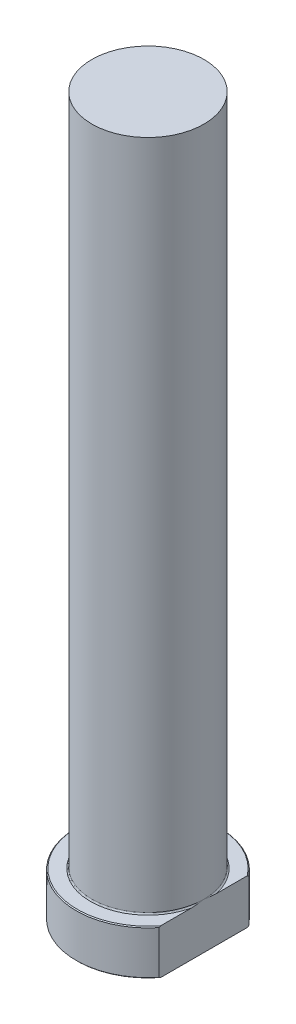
ISO-10303-21;
HEADER;
FILE_DESCRIPTION(('STEP AP214'),'2;1');
FILE_NAME('part.step','',(''),(''),'','','');
FILE_SCHEMA(('AUTOMOTIVE_DESIGN { 1 0 10303 214 1 1 1 1 }'));
ENDSEC;
DATA;
#1=APPLICATION_CONTEXT('core data for automotive mechanical design processes');
#2=APPLICATION_PROTOCOL_DEFINITION('international standard','automotive_design',2000,#1);
#3=PRODUCT_CONTEXT('',#1,'mechanical');
#4=PRODUCT('Part','Part','',(#3));
#5=PRODUCT_RELATED_PRODUCT_CATEGORY('part','',(#4));
#6=PRODUCT_DEFINITION_FORMATION('','',#4);
#7=PRODUCT_DEFINITION_CONTEXT('part definition',#1,'design');
#8=PRODUCT_DEFINITION('design','',#6,#7);
#9=PRODUCT_DEFINITION_SHAPE('','',#8);
#10=(LENGTH_UNIT() NAMED_UNIT(*) SI_UNIT(.MILLI.,.METRE.));
#11=(NAMED_UNIT(*) PLANE_ANGLE_UNIT() SI_UNIT($,.RADIAN.));
#12=(NAMED_UNIT(*) SI_UNIT($,.STERADIAN.) SOLID_ANGLE_UNIT());
#13=UNCERTAINTY_MEASURE_WITH_UNIT(LENGTH_MEASURE(1.E-05),#10,'distance_accuracy_value','');
#14=(GEOMETRIC_REPRESENTATION_CONTEXT(3) GLOBAL_UNCERTAINTY_ASSIGNED_CONTEXT((#13)) GLOBAL_UNIT_ASSIGNED_CONTEXT((#10,
#11,#12)) REPRESENTATION_CONTEXT('',''));
#15=CARTESIAN_POINT('',(0.,0.,0.));
#16=DIRECTION('',(0.,0.,1.));
#17=DIRECTION('',(1.,0.,0.));
#18=AXIS2_PLACEMENT_3D('',#15,#16,#17);
#19=CARTESIAN_POINT('',(0.,0.,0.));
#20=DIRECTION('',(0.,-1.,0.));
#21=DIRECTION('',(0.,0.,-1.));
#22=AXIS2_PLACEMENT_3D('',#19,#20,#21);
#23=PLANE('',#22);
#24=CARTESIAN_POINT('',(0.,0.,0.));
#25=DIRECTION('',(0.,-1.,0.));
#26=DIRECTION('',(0.,0.,-1.));
#27=AXIS2_PLACEMENT_3D('',#24,#25,#26);
#28=CIRCLE('',#27,15.8);
#29=CARTESIAN_POINT('',(12.5,0.,9.66385016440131));
#30=VERTEX_POINT('',#29);
#31=CARTESIAN_POINT('',(12.5,0.,-9.66385016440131));
#32=VERTEX_POINT('',#31);
#33=EDGE_CURVE('E98',#30,#32,#28,.T.);
#34=ORIENTED_EDGE('',*,*,#33,.T.);
#35=DIRECTION('',(0.,0.,1.));
#36=VECTOR('',#35,1.);
#37=CARTESIAN_POINT('',(12.5,0.,-9.98749217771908));
#38=LINE('',#37,#36);
#39=EDGE_CURVE('E83',#32,#30,#38,.T.);
#40=ORIENTED_EDGE('',*,*,#39,.T.);
#41=EDGE_LOOP('',(#34,#40));
#42=FACE_BOUND('',#41,.T.);
#43=ADVANCED_FACE('F32',(#42),#23,.T.);
#44=CARTESIAN_POINT('',(0.,259.958771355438,0.));
#45=DIRECTION('',(0.,1.,0.));
#46=DIRECTION('',(0.,0.,1.));
#47=AXIS2_PLACEMENT_3D('',#44,#45,#46);
#48=CYLINDRICAL_SURFACE('',#47,16.);
#49=CARTESIAN_POINT('',(0.,9.79999999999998,0.));
#50=DIRECTION('',(0.,1.,0.));
#51=DIRECTION('',(0.,0.,1.));
#52=AXIS2_PLACEMENT_3D('',#49,#50,#51);
#53=CIRCLE('',#52,16.);
#54=CARTESIAN_POINT('',(12.5,9.79999999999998,9.98749217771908));
#55=VERTEX_POINT('',#54);
#56=CARTESIAN_POINT('',(12.5,9.79999999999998,-9.98749217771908));
#57=VERTEX_POINT('',#56);
#58=EDGE_CURVE('E104',#55,#57,#53,.F.);
#59=ORIENTED_EDGE('',*,*,#58,.T.);
#60=DIRECTION('',(0.,-1.,0.));
#61=VECTOR('',#60,1.);
#62=CARTESIAN_POINT('',(12.5,160.,-9.98749217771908));
#63=LINE('',#62,#61);
#64=CARTESIAN_POINT('',(12.5,0.200000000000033,-9.98749217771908));
#65=VERTEX_POINT('',#64);
#66=EDGE_CURVE('E183',#57,#65,#63,.T.);
#67=ORIENTED_EDGE('',*,*,#66,.T.);
#68=CARTESIAN_POINT('',(0.,0.200000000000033,0.));
#69=DIRECTION('',(0.,-1.,0.));
#70=DIRECTION('',(0.,0.,-1.));
#71=AXIS2_PLACEMENT_3D('',#68,#69,#70);
#72=CIRCLE('',#71,16.);
#73=CARTESIAN_POINT('',(12.5,0.200000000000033,9.98749217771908));
#74=VERTEX_POINT('',#73);
#75=EDGE_CURVE('E100',#65,#74,#72,.F.);
#76=ORIENTED_EDGE('',*,*,#75,.T.);
#77=DIRECTION('',(0.,-1.,0.));
#78=VECTOR('',#77,1.);
#79=CARTESIAN_POINT('',(12.5,160.,9.98749217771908));
#80=LINE('',#79,#78);
#81=EDGE_CURVE('E93',#55,#74,#80,.T.);
#82=ORIENTED_EDGE('',*,*,#81,.F.);
#83=EDGE_LOOP('',(#59,#67,#76,#82));
#84=FACE_BOUND('',#83,.T.);
#85=ADVANCED_FACE('F158',(#84),#48,.T.);
#86=CARTESIAN_POINT('',(-16.,10.,0.));
#87=DIRECTION('',(0.,1.,0.));
#88=DIRECTION('',(0.,0.,1.));
#89=AXIS2_PLACEMENT_3D('',#86,#87,#88);
#90=PLANE('',#89);
#91=CARTESIAN_POINT('',(0.,10.,0.));
#92=DIRECTION('',(0.,1.,0.));
#93=DIRECTION('',(0.,0.,1.));
#94=AXIS2_PLACEMENT_3D('',#91,#92,#93);
#95=CIRCLE('',#94,15.8);
#96=CARTESIAN_POINT('',(12.5,10.,-9.66385016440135));
#97=VERTEX_POINT('',#96);
#98=CARTESIAN_POINT('',(12.5,10.,9.66385016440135));
#99=VERTEX_POINT('',#98);
#100=EDGE_CURVE('E178',#97,#99,#95,.T.);
#101=ORIENTED_EDGE('',*,*,#100,.T.);
#102=DIRECTION('',(0.,0.,-1.));
#103=VECTOR('',#102,1.);
#104=CARTESIAN_POINT('',(12.5,10.,0.));
#105=LINE('',#104,#103);
#106=CARTESIAN_POINT('',(12.5,10.,2.75499546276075));
#107=VERTEX_POINT('',#106);
#108=EDGE_CURVE('E57',#99,#107,#105,.T.);
#109=ORIENTED_EDGE('',*,*,#108,.T.);
#110=CARTESIAN_POINT('',(0.,10.,0.));
#111=DIRECTION('',(0.,1.,0.));
#112=DIRECTION('',(0.,0.,1.));
#113=AXIS2_PLACEMENT_3D('',#110,#111,#112);
#114=CIRCLE('',#113,12.8);
#115=CARTESIAN_POINT('',(12.5,10.,-2.75499546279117));
#116=VERTEX_POINT('',#115);
#117=EDGE_CURVE('E107',#107,#116,#114,.F.);
#118=ORIENTED_EDGE('',*,*,#117,.T.);
#119=EDGE_CURVE('E136',#116,#97,#105,.T.);
#120=ORIENTED_EDGE('',*,*,#119,.T.);
#121=EDGE_LOOP('',(#101,#109,#118,#120));
#122=FACE_BOUND('',#121,.T.);
#123=ADVANCED_FACE('F147',(#122),#90,.T.);
#124=CARTESIAN_POINT('',(0.,10.,0.));
#125=DIRECTION('',(0.,-1.,0.));
#126=DIRECTION('',(0.,0.,-1.));
#127=AXIS2_PLACEMENT_3D('',#124,#125,#126);
#128=CONICAL_SURFACE('',#127,15.8,0.78539816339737);
#129=ORIENTED_EDGE('',*,*,#58,.F.);
#130=CARTESIAN_POINT('',(12.5,0.520063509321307,21.9732835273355));
#131=CARTESIAN_POINT('',(12.5,0.80202575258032,21.6488770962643));
#132=CARTESIAN_POINT('',(12.5,1.08313217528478,21.3237240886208));
#133=CARTESIAN_POINT('',(12.5,1.64338244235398,20.6717229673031));
#134=CARTESIAN_POINT('',(12.5,1.92252625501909,20.3448748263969));
#135=CARTESIAN_POINT('',(12.5,2.47872061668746,19.6891394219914));
#136=CARTESIAN_POINT('',(12.5,2.75577013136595,19.3602512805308));
#137=CARTESIAN_POINT('',(12.5,3.30732757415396,18.700351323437));
#138=CARTESIAN_POINT('',(12.5,3.58183551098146,18.3693395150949));
#139=CARTESIAN_POINT('',(12.5,4.1340462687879,17.6974852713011));
#140=CARTESIAN_POINT('',(12.5,4.41168315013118,17.3565885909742));
#141=CARTESIAN_POINT('',(12.5,4.96342557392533,16.6719500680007));
#142=CARTESIAN_POINT('',(12.5,5.23753113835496,16.3282082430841));
#143=CARTESIAN_POINT('',(12.5,5.78155974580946,15.6375575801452));
#144=CARTESIAN_POINT('',(12.5,6.05148375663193,15.2906495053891));
#145=CARTESIAN_POINT('',(12.5,6.58649101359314,14.5931154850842));
#146=CARTESIAN_POINT('',(12.5,6.85157426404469,14.2424895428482));
#147=CARTESIAN_POINT('',(12.5,7.37633965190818,13.5365100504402));
#148=CARTESIAN_POINT('',(12.5,7.63601439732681,13.1811509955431));
#149=CARTESIAN_POINT('',(12.5,8.14848411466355,12.465489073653));
#150=CARTESIAN_POINT('',(12.5,8.4012790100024,12.1051861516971));
#151=CARTESIAN_POINT('',(12.5,8.89877262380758,11.3785626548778));
#152=CARTESIAN_POINT('',(12.5,9.1434642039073,11.012237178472));
#153=CARTESIAN_POINT('',(12.5,9.62269650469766,10.2729925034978));
#154=CARTESIAN_POINT('',(12.5,9.85723744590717,9.90007344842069));
#155=CARTESIAN_POINT('',(12.5,10.3121733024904,9.14938704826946));
#156=CARTESIAN_POINT('',(12.5,10.5326589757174,8.77167495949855));
#157=CARTESIAN_POINT('',(12.5,10.9584323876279,8.0076688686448));
#158=CARTESIAN_POINT('',(12.5,11.1637182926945,7.62137383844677));
#159=CARTESIAN_POINT('',(12.5,11.5550521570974,6.83979556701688));
#160=CARTESIAN_POINT('',(12.5,11.741127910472,6.4445263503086));
#161=CARTESIAN_POINT('',(12.5,12.0896891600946,5.64379531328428));
#162=CARTESIAN_POINT('',(12.5,12.2521837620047,5.23833749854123));
#163=CARTESIAN_POINT('',(12.5,12.5515074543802,4.40750298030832));
#164=CARTESIAN_POINT('',(12.5,12.6876692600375,3.98188300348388));
#165=CARTESIAN_POINT('',(12.5,12.9230664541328,3.12036018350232));
#166=CARTESIAN_POINT('',(12.5,13.0223077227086,2.68445898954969));
#167=CARTESIAN_POINT('',(12.5,13.1386499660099,2.02637177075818));
#168=CARTESIAN_POINT('',(12.5,13.1719581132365,1.80697979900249));
#169=CARTESIAN_POINT('',(12.5,13.2273896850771,1.36679892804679));
#170=CARTESIAN_POINT('',(12.5,13.2495147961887,1.14601024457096));
#171=CARTESIAN_POINT('',(12.5,13.2821590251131,0.70357819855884));
#172=CARTESIAN_POINT('',(12.5,13.2926782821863,0.481934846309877));
#173=CARTESIAN_POINT('',(12.5,13.3019073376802,0.0383999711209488));
#174=CARTESIAN_POINT('',(12.5,13.3006171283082,-0.18349155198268));
#175=CARTESIAN_POINT('',(12.5,13.2862386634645,-0.627300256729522));
#176=CARTESIAN_POINT('',(12.5,13.2731286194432,-0.849216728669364));
#177=CARTESIAN_POINT('',(12.5,13.2353379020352,-1.29205679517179));
#178=CARTESIAN_POINT('',(12.5,13.2106571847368,-1.51298038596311));
#179=CARTESIAN_POINT('',(12.5,13.1501829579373,-1.95331306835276));
#180=CARTESIAN_POINT('',(12.5,13.1143886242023,-2.17272204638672));
#181=CARTESIAN_POINT('',(12.5,13.0323124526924,-2.60958138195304));
#182=CARTESIAN_POINT('',(12.5,12.9860290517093,-2.82703144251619));
#183=CARTESIAN_POINT('',(12.5,12.8318007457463,-3.47896053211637));
#184=CARTESIAN_POINT('',(12.5,12.7089145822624,-3.9099597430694));
#185=CARTESIAN_POINT('',(12.5,12.4301044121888,-4.76088311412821));
#186=CARTESIAN_POINT('',(12.5,12.274179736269,-5.18080704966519));
#187=CARTESIAN_POINT('',(12.5,11.899855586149,-6.09704545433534));
#188=CARTESIAN_POINT('',(12.5,11.6752155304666,-6.59079268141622));
#189=CARTESIAN_POINT('',(12.5,11.1959254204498,-7.56361802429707));
#190=CARTESIAN_POINT('',(12.5,10.941258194,-8.04268754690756));
#191=CARTESIAN_POINT('',(12.5,10.4085643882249,-8.98884891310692));
#192=CARTESIAN_POINT('',(12.5,10.1304909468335,-9.45591416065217));
#193=CARTESIAN_POINT('',(12.5,9.55679554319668,-10.3789360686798));
#194=CARTESIAN_POINT('',(12.5,9.26117703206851,-10.8348948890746));
#195=CARTESIAN_POINT('',(12.5,8.65460060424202,-11.7400212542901));
#196=CARTESIAN_POINT('',(12.5,8.34356847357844,-12.1891388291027));
#197=CARTESIAN_POINT('',(12.5,7.71056360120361,-13.0795913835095));
#198=CARTESIAN_POINT('',(12.5,7.38859046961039,-13.5209260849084));
#199=CARTESIAN_POINT('',(12.5,6.73627073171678,-14.3965599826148));
#200=CARTESIAN_POINT('',(12.5,6.40593412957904,-14.8308666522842));
#201=CARTESIAN_POINT('',(12.5,5.73818513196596,-15.6939842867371));
#202=CARTESIAN_POINT('',(12.5,5.4007728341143,-16.1227953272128));
#203=CARTESIAN_POINT('',(12.5,4.69065889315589,-17.0127103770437));
#204=CARTESIAN_POINT('',(12.5,4.3174319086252,-17.4733945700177));
#205=CARTESIAN_POINT('',(12.5,3.56536441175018,-18.3901509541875));
#206=CARTESIAN_POINT('',(12.5,3.18652389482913,-18.8462231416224));
#207=CARTESIAN_POINT('',(12.5,2.42850462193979,-19.7493414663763));
#208=CARTESIAN_POINT('',(12.5,2.04937794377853,-20.1964313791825));
#209=CARTESIAN_POINT('',(12.5,1.28737664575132,-21.0872319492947));
#210=CARTESIAN_POINT('',(12.5,0.904502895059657,-21.5309433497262));
#211=CARTESIAN_POINT('',(12.5,0.520063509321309,-21.9732835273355));
#212=B_SPLINE_CURVE_WITH_KNOTS('',3,(#130,#131,#132,#133,#134,#135,#136,#137,#138,#139,#140,
#141,#142,#143,#144,#145,#146,#147,#148,#149,#150,#151,#152,#153,#154,#155,#156,#157,#158,#159,
#160,#161,#162,#163,#164,#165,#166,#167,#168,#169,#170,#171,#172,#173,#174,#175,#176,#177,#178,
#179,#180,#181,#182,#183,#184,#185,#186,#187,#188,#189,#190,#191,#192,#193,#194,#195,#196,#197,
#198,#199,#200,#201,#202,#203,#204,#205,#206,#207,#208,#209,#210,#211),.UNSPECIFIED.,.F.,.F.,(4,
2,2,2,2,2,2,2,2,2,2,2,2,2,2,2,2,2,2,2,2,2,2,2,2,2,2,2,2,2,2,2,2,2,2,2,2,2,2,2,4),(0.,
1.28945110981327,2.57892299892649,3.86899482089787,5.15906221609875,6.47799420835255,
7.79691798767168,9.11553180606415,10.4341444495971,11.7544545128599,13.0747792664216,
14.3962377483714,15.7176675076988,17.0294519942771,18.3413944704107,19.6514113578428,
20.9609210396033,22.3001940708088,23.6392537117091,24.3047314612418,24.9701088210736,
25.6354781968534,26.3008480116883,26.9674468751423,27.6340482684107,28.3006991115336,
28.9674493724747,30.3101828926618,31.6529436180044,33.2788964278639,34.9057836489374,
36.5360093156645,38.1659153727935,39.8046231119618,41.4433893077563,43.0802801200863,
44.7171483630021,46.4957886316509,48.2744303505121,50.0329971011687,51.7911651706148),.UNSPECIFIED.);
#213=EDGE_CURVE('E135',#55,#99,#212,.T.);
#214=ORIENTED_EDGE('',*,*,#213,.T.);
#215=ORIENTED_EDGE('',*,*,#100,.F.);
#216=EDGE_CURVE('E127',#97,#57,#212,.T.);
#217=ORIENTED_EDGE('',*,*,#216,.T.);
#218=EDGE_LOOP('',(#129,#214,#215,#217));
#219=FACE_BOUND('',#218,.T.);
#220=ADVANCED_FACE('F143',(#219),#128,.T.);
#221=CARTESIAN_POINT('',(0.,0.200000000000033,0.));
#222=DIRECTION('',(0.,1.,0.));
#223=DIRECTION('',(0.,0.,1.));
#224=AXIS2_PLACEMENT_3D('',#221,#222,#223);
#225=CONICAL_SURFACE('',#224,16.,0.785398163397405);
#226=ORIENTED_EDGE('',*,*,#75,.F.);
#227=CARTESIAN_POINT('',(12.5,9.47993649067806,-21.9732835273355));
#228=CARTESIAN_POINT('',(12.5,9.19797424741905,-21.6488770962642));
#229=CARTESIAN_POINT('',(12.5,8.9168678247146,-21.3237240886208));
#230=CARTESIAN_POINT('',(12.5,8.35661755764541,-20.6717229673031));
#231=CARTESIAN_POINT('',(12.5,8.0774737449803,-20.3448748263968));
#232=CARTESIAN_POINT('',(12.5,7.52127938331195,-19.6891394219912));
#233=CARTESIAN_POINT('',(12.5,7.24422986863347,-19.3602512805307));
#234=CARTESIAN_POINT('',(12.5,6.69267242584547,-18.7003513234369));
#235=CARTESIAN_POINT('',(12.5,6.41816448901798,-18.3693395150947));
#236=CARTESIAN_POINT('',(12.5,5.86595373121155,-17.6974852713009));
#237=CARTESIAN_POINT('',(12.5,5.58831684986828,-17.356588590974));
#238=CARTESIAN_POINT('',(12.5,5.03657442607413,-16.6719500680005));
#239=CARTESIAN_POINT('',(12.5,4.76246886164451,-16.3282082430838));
#240=CARTESIAN_POINT('',(12.5,4.21844025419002,-15.6375575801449));
#241=CARTESIAN_POINT('',(12.5,3.94851624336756,-15.2906495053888));
#242=CARTESIAN_POINT('',(12.5,3.41350898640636,-14.5931154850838));
#243=CARTESIAN_POINT('',(12.5,3.14842573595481,-14.2424895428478));
#244=CARTESIAN_POINT('',(12.5,2.62366034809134,-13.5365100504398));
#245=CARTESIAN_POINT('',(12.5,2.36398560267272,-13.1811509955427));
#246=CARTESIAN_POINT('',(12.5,1.851515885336,-12.4654890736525));
#247=CARTESIAN_POINT('',(12.5,1.59872098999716,-12.1051861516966));
#248=CARTESIAN_POINT('',(12.5,1.10122737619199,-11.3785626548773));
#249=CARTESIAN_POINT('',(12.5,0.856535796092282,-11.0122371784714));
#250=CARTESIAN_POINT('',(12.5,0.377303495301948,-10.2729925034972));
#251=CARTESIAN_POINT('',(12.5,0.142762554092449,-9.90007344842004));
#252=CARTESIAN_POINT('',(12.5,-0.312173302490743,-9.14938704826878));
#253=CARTESIAN_POINT('',(12.5,-0.532658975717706,-8.77167495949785));
#254=CARTESIAN_POINT('',(12.5,-0.958432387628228,-8.00766886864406));
#255=CARTESIAN_POINT('',(12.5,-1.16371829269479,-7.62137383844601));
#256=CARTESIAN_POINT('',(12.5,-1.55505215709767,-6.83979556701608));
#257=CARTESIAN_POINT('',(12.5,-1.74112791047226,-6.44452635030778));
#258=CARTESIAN_POINT('',(12.5,-2.08968916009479,-5.64379531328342));
#259=CARTESIAN_POINT('',(12.5,-2.25218376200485,-5.23833749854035));
#260=CARTESIAN_POINT('',(12.5,-2.55150745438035,-4.4075029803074));
#261=CARTESIAN_POINT('',(12.5,-2.6876692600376,-3.98188300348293));
#262=CARTESIAN_POINT('',(12.5,-2.92306645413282,-3.12036018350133));
#263=CARTESIAN_POINT('',(12.5,-3.02230772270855,-2.68445898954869));
#264=CARTESIAN_POINT('',(12.5,-3.13864996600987,-2.02637177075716));
#265=CARTESIAN_POINT('',(12.5,-3.17195811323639,-1.80697979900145));
#266=CARTESIAN_POINT('',(12.5,-3.22738968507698,-1.36679892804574));
#267=CARTESIAN_POINT('',(12.5,-3.24951479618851,-1.1460102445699));
#268=CARTESIAN_POINT('',(12.5,-3.28215902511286,-0.703578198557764));
#269=CARTESIAN_POINT('',(12.5,-3.29267828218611,-0.481934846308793));
#270=CARTESIAN_POINT('',(12.5,-3.30190733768,-0.0383999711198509));
#271=CARTESIAN_POINT('',(12.5,-3.30061712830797,0.183491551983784));
#272=CARTESIAN_POINT('',(12.5,-3.28623866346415,0.627300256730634));
#273=CARTESIAN_POINT('',(12.5,-3.27312861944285,0.849216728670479));
#274=CARTESIAN_POINT('',(12.5,-3.2353379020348,1.29205679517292));
#275=CARTESIAN_POINT('',(12.5,-3.21065718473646,1.51298038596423));
#276=CARTESIAN_POINT('',(12.5,-3.15018295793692,1.95331306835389));
#277=CARTESIAN_POINT('',(12.5,-3.11438862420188,2.17272204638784));
#278=CARTESIAN_POINT('',(12.5,-3.03231245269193,2.60958138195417));
#279=CARTESIAN_POINT('',(12.5,-2.98602905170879,2.82703144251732));
#280=CARTESIAN_POINT('',(12.5,-2.83180074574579,3.4789605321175));
#281=CARTESIAN_POINT('',(12.5,-2.70891458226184,3.90995974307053));
#282=CARTESIAN_POINT('',(12.5,-2.43010441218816,4.76088311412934));
#283=CARTESIAN_POINT('',(12.5,-2.27417973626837,5.18080704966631));
#284=CARTESIAN_POINT('',(12.5,-1.89985558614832,6.09704545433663));
#285=CARTESIAN_POINT('',(12.5,-1.67521553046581,6.59079268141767));
#286=CARTESIAN_POINT('',(12.5,-1.19592542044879,7.56361802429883));
#287=CARTESIAN_POINT('',(12.5,-0.941258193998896,8.04268754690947));
#288=CARTESIAN_POINT('',(12.5,-0.408564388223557,8.98884891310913));
#289=CARTESIAN_POINT('',(12.5,-0.130490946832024,9.45591416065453));
#290=CARTESIAN_POINT('',(12.5,0.443204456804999,10.3789360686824));
#291=CARTESIAN_POINT('',(12.5,0.738822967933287,10.8348948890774));
#292=CARTESIAN_POINT('',(12.5,1.34539939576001,11.7400212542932));
#293=CARTESIAN_POINT('',(12.5,1.65643152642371,12.1891388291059));
#294=CARTESIAN_POINT('',(12.5,2.28943639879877,13.079591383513));
#295=CARTESIAN_POINT('',(12.5,2.61140953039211,13.520926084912));
#296=CARTESIAN_POINT('',(12.5,3.26372926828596,14.3965599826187));
#297=CARTESIAN_POINT('',(12.5,3.59406587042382,14.8308666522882));
#298=CARTESIAN_POINT('',(12.5,4.26181486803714,15.6939842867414));
#299=CARTESIAN_POINT('',(12.5,4.59922716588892,16.1227953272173));
#300=CARTESIAN_POINT('',(12.5,5.30934110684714,17.0127103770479));
#301=CARTESIAN_POINT('',(12.5,5.68256809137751,17.4733945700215));
#302=CARTESIAN_POINT('',(12.5,6.43463558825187,18.3901509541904));
#303=CARTESIAN_POINT('',(12.5,6.81347610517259,18.846223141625));
#304=CARTESIAN_POINT('',(12.5,7.57149537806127,19.7493414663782));
#305=CARTESIAN_POINT('',(12.5,7.95062205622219,20.196431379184));
#306=CARTESIAN_POINT('',(12.5,8.71262335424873,21.0872319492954));
#307=CARTESIAN_POINT('',(12.5,9.09549710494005,21.5309433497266));
#308=CARTESIAN_POINT('',(12.5,9.47993649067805,21.9732835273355));
#309=B_SPLINE_CURVE_WITH_KNOTS('',3,(#227,#228,#229,#230,#231,#232,#233,#234,#235,#236,#237,
#238,#239,#240,#241,#242,#243,#244,#245,#246,#247,#248,#249,#250,#251,#252,#253,#254,#255,#256,
#257,#258,#259,#260,#261,#262,#263,#264,#265,#266,#267,#268,#269,#270,#271,#272,#273,#274,#275,
#276,#277,#278,#279,#280,#281,#282,#283,#284,#285,#286,#287,#288,#289,#290,#291,#292,#293,#294,
#295,#296,#297,#298,#299,#300,#301,#302,#303,#304,#305,#306,#307,#308),.UNSPECIFIED.,.F.,.F.,(4,
2,2,2,2,2,2,2,2,2,2,2,2,2,2,2,2,2,2,2,2,2,2,2,2,2,2,2,2,2,2,2,2,2,2,2,2,2,2,2,4),(0.,
1.28945110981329,2.57892299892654,3.86899482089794,5.15906221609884,6.47799420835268,
7.79691798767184,9.11553180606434,10.4341444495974,11.7544545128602,13.0747792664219,
14.3962377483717,15.7176675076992,17.0294519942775,18.3413944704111,19.6514113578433,
20.9609210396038,22.3001940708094,23.6392537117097,24.3047314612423,24.9701088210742,
25.635478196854,26.3008480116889,26.9674468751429,27.6340482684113,28.3006991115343,
28.9674493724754,30.3101828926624,31.6529436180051,33.2788964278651,34.9057836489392,
36.5360093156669,38.1659153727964,39.8046231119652,41.4433893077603,43.0802801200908,
44.7171483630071,46.4957886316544,48.2744303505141,50.0329971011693,51.7911651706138),.UNSPECIFIED.);
#310=EDGE_CURVE('E86',#65,#32,#309,.T.);
#311=ORIENTED_EDGE('',*,*,#310,.T.);
#312=ORIENTED_EDGE('',*,*,#33,.F.);
#313=EDGE_CURVE('E89',#30,#74,#309,.T.);
#314=ORIENTED_EDGE('',*,*,#313,.T.);
#315=EDGE_LOOP('',(#226,#311,#312,#314));
#316=FACE_BOUND('',#315,.T.);
#317=ADVANCED_FACE('F97',(#316),#225,.T.);
#318=CARTESIAN_POINT('',(0.,10.3,0.));
#319=DIRECTION('',(0.,1.,0.));
#320=DIRECTION('',(0.,0.,1.));
#321=AXIS2_PLACEMENT_3D('',#318,#319,#320);
#322=TOROIDAL_SURFACE('',#321,12.8,0.3);
#323=CARTESIAN_POINT('',(12.5,10.3,0.));
#324=CARTESIAN_POINT('',(12.5,10.300000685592,-6.08820746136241E-09));
#325=CARTESIAN_POINT('',(12.5,10.300001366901,-5.08876655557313E-07));
#326=CARTESIAN_POINT('',(12.5,10.3000026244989,-1.73661802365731E-06));
#327=CARTESIAN_POINT('',(12.5,10.3000031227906,-2.48490474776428E-06));
#328=CARTESIAN_POINT('',(12.5,10.3000042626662,-4.35291163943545E-06));
#329=CARTESIAN_POINT('',(12.5,10.3000048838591,-5.50325566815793E-06));
#330=CARTESIAN_POINT('',(12.5,10.3000058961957,-7.76527023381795E-06));
#331=CARTESIAN_POINT('',(12.5,10.3000063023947,-8.87193032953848E-06));
#332=CARTESIAN_POINT('',(12.5,10.3000080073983,-1.35535117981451E-05));
#333=CARTESIAN_POINT('',(12.5,10.300009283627,-1.71478698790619E-05));
#334=CARTESIAN_POINT('',(12.5,10.3000111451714,-2.39305737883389E-05));
#335=CARTESIAN_POINT('',(12.5,10.30001180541,-2.70989461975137E-05));
#336=CARTESIAN_POINT('',(12.5,10.3000165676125,-5.05411717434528E-05));
#337=CARTESIAN_POINT('',(12.5,10.3000200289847,-7.09185071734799E-05));
#338=CARTESIAN_POINT('',(12.5,10.300032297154,-0.000151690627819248));
#339=CARTESIAN_POINT('',(12.5,10.3000383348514,-0.000212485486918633));
#340=CARTESIAN_POINT('',(12.5,10.3000659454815,-0.000448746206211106));
#341=CARTESIAN_POINT('',(12.5,10.3000952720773,-0.000623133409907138));
#342=CARTESIAN_POINT('',(12.5,10.3002039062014,-0.00128772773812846));
#343=CARTESIAN_POINT('',(12.5,10.3002776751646,-0.00177866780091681));
#344=CARTESIAN_POINT('',(12.5,10.3005641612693,-0.00366503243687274));
#345=CARTESIAN_POINT('',(12.5,10.3007823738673,-0.00505974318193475));
#346=CARTESIAN_POINT('',(12.5,10.3018133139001,-0.0116680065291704));
#347=CARTESIAN_POINT('',(12.5,10.3026180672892,-0.0168825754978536));
#348=CARTESIAN_POINT('',(12.5,10.3120514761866,-0.0779781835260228));
#349=CARTESIAN_POINT('',(12.5,10.3207244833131,-0.133853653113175));
#350=CARTESIAN_POINT('',(12.5,10.3388658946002,-0.251282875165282));
#351=CARTESIAN_POINT('',(12.5,10.3483257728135,-0.312837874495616));
#352=CARTESIAN_POINT('',(12.5,10.3639287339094,-0.415046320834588));
#353=CARTESIAN_POINT('',(12.5,10.3701065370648,-0.455694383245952));
#354=CARTESIAN_POINT('',(12.5,10.3822268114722,-0.53596333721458));
#355=CARTESIAN_POINT('',(12.5,10.3881712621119,-0.57558393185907));
#356=CARTESIAN_POINT('',(12.5,10.4217048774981,-0.800849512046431));
#357=CARTESIAN_POINT('',(12.5,10.4483430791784,-0.986638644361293));
#358=CARTESIAN_POINT('',(12.5,10.4978676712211,-1.36073085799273));
#359=CARTESIAN_POINT('',(12.5,10.5207116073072,-1.54903981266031));
#360=CARTESIAN_POINT('',(12.5,10.5510813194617,-1.84372746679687));
#361=CARTESIAN_POINT('',(12.5,10.5609338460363,-1.94986334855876));
#362=CARTESIAN_POINT('',(12.5,10.5778401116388,-2.16235517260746));
#363=CARTESIAN_POINT('',(12.5,10.5848941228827,-2.26871109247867));
#364=CARTESIAN_POINT('',(12.5,10.5953321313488,-2.48120575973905));
#365=CARTESIAN_POINT('',(12.5,10.5987299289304,-2.58734380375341));
#366=CARTESIAN_POINT('',(12.5,10.6006981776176,-2.79965289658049));
#367=CARTESIAN_POINT('',(12.5,10.5992708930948,-2.90582390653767));
#368=CARTESIAN_POINT('',(12.5,10.5920660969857,-3.06242328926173));
#369=CARTESIAN_POINT('',(12.5,10.5889531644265,-3.11297361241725));
#370=CARTESIAN_POINT('',(12.5,10.5807735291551,-3.21396863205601));
#371=CARTESIAN_POINT('',(12.5,10.5757051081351,-3.26441319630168));
#372=CARTESIAN_POINT('',(12.5,10.5631618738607,-3.36425835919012));
#373=CARTESIAN_POINT('',(12.5,10.555723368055,-3.41366343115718));
#374=CARTESIAN_POINT('',(12.5,10.5375916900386,-3.51185380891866));
#375=CARTESIAN_POINT('',(12.5,10.5269024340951,-3.56063978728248));
#376=CARTESIAN_POINT('',(12.5,10.5054348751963,-3.6391830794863));
#377=CARTESIAN_POINT('',(12.5,10.4961365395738,-3.66933696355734));
#378=CARTESIAN_POINT('',(12.5,10.474763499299,-3.72862196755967));
#379=CARTESIAN_POINT('',(12.5,10.462694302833,-3.75775498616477));
#380=CARTESIAN_POINT('',(12.5,10.4380385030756,-3.80618627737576));
#381=CARTESIAN_POINT('',(12.5,10.4265070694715,-3.8259857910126));
#382=CARTESIAN_POINT('',(12.5,10.4063926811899,-3.85382979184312));
#383=CARTESIAN_POINT('',(12.5,10.3991733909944,-3.8628437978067));
#384=CARTESIAN_POINT('',(12.5,10.3835233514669,-3.87975615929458));
#385=CARTESIAN_POINT('',(12.5,10.3750969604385,-3.88765833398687));
#386=CARTESIAN_POINT('',(12.5,10.3611065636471,-3.89824999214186));
#387=CARTESIAN_POINT('',(12.5,10.3560749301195,-3.9016366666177));
#388=CARTESIAN_POINT('',(12.5,10.3455861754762,-3.90768435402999));
#389=CARTESIAN_POINT('',(12.5,10.3401292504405,-3.91034569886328));
#390=CARTESIAN_POINT('',(12.5,10.3287657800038,-3.91474619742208));
#391=CARTESIAN_POINT('',(12.5,10.3228544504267,-3.91647335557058));
#392=CARTESIAN_POINT('',(12.5,10.3108092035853,-3.91873417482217));
#393=CARTESIAN_POINT('',(12.5,10.3046756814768,-3.91926985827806));
#394=CARTESIAN_POINT('',(12.5,10.293185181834,-3.91908606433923));
#395=CARTESIAN_POINT('',(12.5,10.2878253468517,-3.91851265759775));
#396=CARTESIAN_POINT('',(12.5,10.2772818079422,-3.91645967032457));
#397=CARTESIAN_POINT('',(12.5,10.2720982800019,-3.91497921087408));
#398=CARTESIAN_POINT('',(12.5,10.2604757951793,-3.91068184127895));
#399=CARTESIAN_POINT('',(12.5,10.2541380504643,-3.90759459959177));
#400=CARTESIAN_POINT('',(12.5,10.2420308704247,-3.90046137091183));
#401=CARTESIAN_POINT('',(12.5,10.2362627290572,-3.89641326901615));
#402=CARTESIAN_POINT('',(12.5,10.2213149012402,-3.88449159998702));
#403=CARTESIAN_POINT('',(12.5,10.2126659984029,-3.87596096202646));
#404=CARTESIAN_POINT('',(12.5,10.1966439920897,-3.85778795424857));
#405=CARTESIAN_POINT('',(12.5,10.1892747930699,-3.84814232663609));
#406=CARTESIAN_POINT('',(12.5,10.1725709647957,-3.82389784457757));
#407=CARTESIAN_POINT('',(12.5,10.1637497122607,-3.80894948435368));
#408=CARTESIAN_POINT('',(12.5,10.1475318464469,-3.77828784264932));
#409=CARTESIAN_POINT('',(12.5,10.1401383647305,-3.76257297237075));
#410=CARTESIAN_POINT('',(12.5,10.1264047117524,-3.73059893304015));
#411=CARTESIAN_POINT('',(12.5,10.1200701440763,-3.71433738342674));
#412=CARTESIAN_POINT('',(12.5,10.1082745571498,-3.68152468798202));
#413=CARTESIAN_POINT('',(12.5,10.1028126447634,-3.66497385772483));
#414=CARTESIAN_POINT('',(12.5,10.0886990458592,-3.61898372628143));
#415=CARTESIAN_POINT('',(12.5,10.0807822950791,-3.58931942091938));
#416=CARTESIAN_POINT('',(12.5,10.0665587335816,-3.52960268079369));
#417=CARTESIAN_POINT('',(12.5,10.0602528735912,-3.49955002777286));
#418=CARTESIAN_POINT('',(12.5,10.0432020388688,-3.40892020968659));
#419=CARTESIAN_POINT('',(12.5,10.0343558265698,-3.34798718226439));
#420=CARTESIAN_POINT('',(12.5,10.0201228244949,-3.22565891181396));
#421=CARTESIAN_POINT('',(12.5,10.0147414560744,-3.16426309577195));
#422=CARTESIAN_POINT('',(12.5,10.0066240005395,-3.04138251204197));
#423=CARTESIAN_POINT('',(12.5,10.0038844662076,-2.97989796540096));
#424=CARTESIAN_POINT('',(12.5,10.0005131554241,-2.8577235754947));
#425=CARTESIAN_POINT('',(12.5,9.99985290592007,-2.79703443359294));
#426=CARTESIAN_POINT('',(12.5,10.0002004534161,-2.67565900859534));
#427=CARTESIAN_POINT('',(12.5,10.0012083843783,-2.61497272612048));
#428=CARTESIAN_POINT('',(12.5,10.0063170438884,-2.43292800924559));
#429=CARTESIAN_POINT('',(12.5,10.0125034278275,-2.31162822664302));
#430=CARTESIAN_POINT('',(12.5,10.028923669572,-2.06913309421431));
#431=CARTESIAN_POINT('',(12.5,10.0391638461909,-1.94793820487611));
#432=CARTESIAN_POINT('',(12.5,10.0626694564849,-1.70583328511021));
#433=CARTESIAN_POINT('',(12.5,10.0759352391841,-1.58492328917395));
#434=CARTESIAN_POINT('',(12.5,10.1189883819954,-1.22310927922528));
#435=CARTESIAN_POINT('',(12.5,10.1520738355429,-0.982605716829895));
#436=CARTESIAN_POINT('',(12.5,10.2222679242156,-0.502161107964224));
#437=CARTESIAN_POINT('',(12.5,10.2593775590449,-0.262220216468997));
#438=CARTESIAN_POINT('',(12.5,10.2965571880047,-0.0222236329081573));
#439=CARTESIAN_POINT('',(12.5,10.2965669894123,-0.0221603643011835));
#440=CARTESIAN_POINT('',(12.5,10.2972687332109,-0.017630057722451));
#441=CARTESIAN_POINT('',(12.5,10.2979552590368,-0.0131622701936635));
#442=CARTESIAN_POINT('',(12.5,10.2989608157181,-0.00672404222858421));
#443=CARTESIAN_POINT('',(12.5,10.2992709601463,-0.00475237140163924));
#444=CARTESIAN_POINT('',(12.5,10.299665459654,-0.00214447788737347));
#445=CARTESIAN_POINT('',(12.5,10.299760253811,-0.0015097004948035));
#446=CARTESIAN_POINT('',(12.5,10.2998957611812,-0.000678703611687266));
#447=CARTESIAN_POINT('',(12.5,10.2999287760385,-0.000481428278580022));
#448=CARTESIAN_POINT('',(12.5,10.2999592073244,-0.000219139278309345));
#449=CARTESIAN_POINT('',(12.5,10.2999655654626,-0.000155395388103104));
#450=CARTESIAN_POINT('',(12.5,10.2999789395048,-7.14631131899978E-05));
#451=CARTESIAN_POINT('',(12.5,10.2999826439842,-5.07827878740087E-05));
#452=CARTESIAN_POINT('',(12.5,10.2999877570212,-2.70484026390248E-05));
#453=CARTESIAN_POINT('',(12.5,10.2999884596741,-2.3870209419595E-05));
#454=CARTESIAN_POINT('',(12.5,10.2999904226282,-1.70721258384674E-05));
#455=CARTESIAN_POINT('',(12.5,10.2999917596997,-1.34738016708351E-05));
#456=CARTESIAN_POINT('',(12.5,10.2999935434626,-8.79208554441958E-06));
#457=CARTESIAN_POINT('',(12.5,10.2999939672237,-7.68838220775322E-06));
#458=CARTESIAN_POINT('',(12.5,10.2999950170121,-5.43535458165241E-06));
#459=CARTESIAN_POINT('',(12.5,10.2999956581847,-4.29133306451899E-06));
#460=CARTESIAN_POINT('',(12.5,10.2999968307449,-2.43685216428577E-06));
#461=CARTESIAN_POINT('',(12.5,10.29999734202,-1.69517537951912E-06));
#462=CARTESIAN_POINT('',(12.5,10.2999986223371,-4.8608665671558E-07));
#463=CARTESIAN_POINT('',(12.5,10.2999993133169,6.09789656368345E-09));
#464=CARTESIAN_POINT('',(12.5,10.3,0.));
#465=B_SPLINE_CURVE_WITH_KNOTS('',3,(#323,#324,#325,#326,#327,#328,#329,#330,#331,#332,#333,
#334,#335,#336,#337,#338,#339,#340,#341,#342,#343,#344,#345,#346,#347,#348,#349,#350,#351,#352,
#353,#354,#355,#356,#357,#358,#359,#360,#361,#362,#363,#364,#365,#366,#367,#368,#369,#370,#371,
#372,#373,#374,#375,#376,#377,#378,#379,#380,#381,#382,#383,#384,#385,#386,#387,#388,#389,#390,
#391,#392,#393,#394,#395,#396,#397,#398,#399,#400,#401,#402,#403,#404,#405,#406,#407,#408,#409,
#410,#411,#412,#413,#414,#415,#416,#417,#418,#419,#420,#421,#422,#423,#424,#425,#426,#427,#428,
#429,#430,#431,#432,#433,#434,#435,#436,#437,#438,#439,#440,#441,#442,#443,#444,#445,#446,#447,
#448,#449,#450,#451,#452,#453,#454,#455,#456,#457,#458,#459,#460,#461,#462,#463,#464),
.UNSPECIFIED.,.T.,.F.,(4,2,2,2,2,2,2,2,2,2,2,2,2,2,2,2,2,2,2,2,2,2,2,2,2,2,2,2,2,2,2,2,2,2,2,2,
2,2,2,2,2,2,2,2,2,2,2,2,2,2,2,2,2,2,2,2,2,2,2,2,2,2,2,2,2,2,2,2,2,2,4),(0.,2.18904227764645E-06,
4.96900724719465E-06,8.83863216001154E-06,1.23796733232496E-05,2.37905621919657E-05,
3.34897803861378E-05,9.54946146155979E-05,0.000278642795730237,0.000808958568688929,
0.00229845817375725,0.00653331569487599,0.0223624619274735,0.191994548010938,0.378827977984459,
0.502172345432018,0.622364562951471,1.1854146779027,1.75439293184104,2.07414276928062,
2.39386149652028,2.71236916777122,3.0307273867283,3.18263838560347,3.33468317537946,
3.48450253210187,3.63414210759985,3.72872153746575,3.82311455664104,3.89154751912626,
3.92612498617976,3.96058061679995,3.97873163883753,3.9968743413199,4.01524478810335,
4.03358402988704,4.04967096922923,4.06577352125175,4.08680352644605,4.10788025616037,
4.14411883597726,4.18046611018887,4.23240896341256,4.28446448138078,4.3367872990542,
4.389056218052,4.48109408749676,4.57318615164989,4.75772997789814,4.94256185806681,
5.12715223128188,5.30920363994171,5.4912696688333,5.85553516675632,6.22037071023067,
6.58524836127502,7.31345308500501,8.04183912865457,8.04203119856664,8.05559213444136,
8.06157963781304,8.0635052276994,8.06410510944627,8.06429712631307,8.06436014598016,
8.06436990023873,8.06438138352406,8.06438493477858,8.06438881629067,8.06439160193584,
8.06439379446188),.UNSPECIFIED.);
#466=CARTESIAN_POINT('',(12.5,10.3,0.));
#467=VERTEX_POINT('',#466);
#468=EDGE_CURVE('E11',#116,#467,#465,.T.);
#469=ORIENTED_EDGE('',*,*,#468,.F.);
#470=ORIENTED_EDGE('',*,*,#117,.F.);
#471=CARTESIAN_POINT('',(12.5,10.3,0.));
#472=CARTESIAN_POINT('',(12.5,10.299999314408,6.08820735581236E-09));
#473=CARTESIAN_POINT('',(12.5,10.299998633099,5.08876655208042E-07));
#474=CARTESIAN_POINT('',(12.5,10.2999973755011,1.73661802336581E-06));
#475=CARTESIAN_POINT('',(12.5,10.2999968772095,2.48490474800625E-06));
#476=CARTESIAN_POINT('',(12.5,10.2999957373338,4.35291163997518E-06));
#477=CARTESIAN_POINT('',(12.5,10.2999951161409,5.50325566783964E-06));
#478=CARTESIAN_POINT('',(12.5,10.2999941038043,7.76527023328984E-06));
#479=CARTESIAN_POINT('',(12.5,10.2999936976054,8.87193032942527E-06));
#480=CARTESIAN_POINT('',(12.5,10.2999919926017,1.35535117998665E-05));
#481=CARTESIAN_POINT('',(12.5,10.2999907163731,1.71478698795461E-05));
#482=CARTESIAN_POINT('',(12.5,10.2999888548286,2.39305737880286E-05));
#483=CARTESIAN_POINT('',(12.5,10.29998819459,2.70989461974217E-05));
#484=CARTESIAN_POINT('',(12.5,10.2999834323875,5.05411717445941E-05));
#485=CARTESIAN_POINT('',(12.5,10.2999799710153,7.09185071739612E-05));
#486=CARTESIAN_POINT('',(12.5,10.299967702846,0.000151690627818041));
#487=CARTESIAN_POINT('',(12.5,10.2999616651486,0.000212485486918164));
#488=CARTESIAN_POINT('',(12.5,10.2999340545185,0.000448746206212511));
#489=CARTESIAN_POINT('',(12.5,10.2999047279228,0.000623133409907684));
#490=CARTESIAN_POINT('',(12.5,10.2997960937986,0.00128772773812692));
#491=CARTESIAN_POINT('',(12.5,10.2997223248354,0.00177866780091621));
#492=CARTESIAN_POINT('',(12.5,10.2994358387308,0.00366503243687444));
#493=CARTESIAN_POINT('',(12.5,10.2992176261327,0.00505974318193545));
#494=CARTESIAN_POINT('',(12.5,10.2981866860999,0.0116680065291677));
#495=CARTESIAN_POINT('',(12.5,10.2973819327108,0.0168825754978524));
#496=CARTESIAN_POINT('',(12.5,10.2879485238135,0.0779781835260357));
#497=CARTESIAN_POINT('',(12.5,10.2792755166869,0.133853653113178));
#498=CARTESIAN_POINT('',(12.5,10.2611341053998,0.251282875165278));
#499=CARTESIAN_POINT('',(12.5,10.2516742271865,0.312837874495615));
#500=CARTESIAN_POINT('',(12.5,10.2360712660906,0.415046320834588));
#501=CARTESIAN_POINT('',(12.5,10.2298934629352,0.455694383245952));
#502=CARTESIAN_POINT('',(12.5,10.2177731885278,0.53596333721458));
#503=CARTESIAN_POINT('',(12.5,10.2118287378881,0.57558393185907));
#504=CARTESIAN_POINT('',(12.5,10.1782951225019,0.800849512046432));
#505=CARTESIAN_POINT('',(12.5,10.1516569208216,0.986638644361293));
#506=CARTESIAN_POINT('',(12.5,10.1021323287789,1.36073085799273));
#507=CARTESIAN_POINT('',(12.5,10.0792883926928,1.54903981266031));
#508=CARTESIAN_POINT('',(12.5,10.0489186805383,1.84372746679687));
#509=CARTESIAN_POINT('',(12.5,10.0390661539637,1.94986334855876));
#510=CARTESIAN_POINT('',(12.5,10.0221598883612,2.16235517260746));
#511=CARTESIAN_POINT('',(12.5,10.0151058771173,2.26871109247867));
#512=CARTESIAN_POINT('',(12.5,10.0046678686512,2.48120575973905));
#513=CARTESIAN_POINT('',(12.5,10.0012700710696,2.58734380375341));
#514=CARTESIAN_POINT('',(12.5,9.99930182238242,2.79965289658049));
#515=CARTESIAN_POINT('',(12.5,10.0007291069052,2.90582390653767));
#516=CARTESIAN_POINT('',(12.5,10.0079339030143,3.06242328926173));
#517=CARTESIAN_POINT('',(12.5,10.0110468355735,3.11297361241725));
#518=CARTESIAN_POINT('',(12.5,10.0192264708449,3.21396863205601));
#519=CARTESIAN_POINT('',(12.5,10.0242948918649,3.26441319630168));
#520=CARTESIAN_POINT('',(12.5,10.0368381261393,3.36425835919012));
#521=CARTESIAN_POINT('',(12.5,10.044276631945,3.41366343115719));
#522=CARTESIAN_POINT('',(12.5,10.0624083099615,3.51185380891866));
#523=CARTESIAN_POINT('',(12.5,10.0730975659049,3.56063978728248));
#524=CARTESIAN_POINT('',(12.5,10.0945651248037,3.6391830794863));
#525=CARTESIAN_POINT('',(12.5,10.1038634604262,3.66933696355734));
#526=CARTESIAN_POINT('',(12.5,10.125236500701,3.72862196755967));
#527=CARTESIAN_POINT('',(12.5,10.137305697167,3.75775498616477));
#528=CARTESIAN_POINT('',(12.5,10.1619614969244,3.80618627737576));
#529=CARTESIAN_POINT('',(12.5,10.1734929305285,3.8259857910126));
#530=CARTESIAN_POINT('',(12.5,10.1936073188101,3.85382979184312));
#531=CARTESIAN_POINT('',(12.5,10.2008266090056,3.8628437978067));
#532=CARTESIAN_POINT('',(12.5,10.2164766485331,3.87975615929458));
#533=CARTESIAN_POINT('',(12.5,10.2249030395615,3.88765833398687));
#534=CARTESIAN_POINT('',(12.5,10.2388934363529,3.89824999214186));
#535=CARTESIAN_POINT('',(12.5,10.2439250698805,3.9016366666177));
#536=CARTESIAN_POINT('',(12.5,10.2544138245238,3.90768435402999));
#537=CARTESIAN_POINT('',(12.5,10.2598707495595,3.91034569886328));
#538=CARTESIAN_POINT('',(12.5,10.2712342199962,3.91474619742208));
#539=CARTESIAN_POINT('',(12.5,10.2771455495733,3.91647335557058));
#540=CARTESIAN_POINT('',(12.5,10.2891907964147,3.91873417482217));
#541=CARTESIAN_POINT('',(12.5,10.2953243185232,3.91926985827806));
#542=CARTESIAN_POINT('',(12.5,10.306814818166,3.91908606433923));
#543=CARTESIAN_POINT('',(12.5,10.3121746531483,3.91851265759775));
#544=CARTESIAN_POINT('',(12.5,10.3227181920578,3.91645967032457));
#545=CARTESIAN_POINT('',(12.5,10.3279017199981,3.91497921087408));
#546=CARTESIAN_POINT('',(12.5,10.3395242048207,3.91068184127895));
#547=CARTESIAN_POINT('',(12.5,10.3458619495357,3.90759459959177));
#548=CARTESIAN_POINT('',(12.5,10.3579691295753,3.90046137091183));
#549=CARTESIAN_POINT('',(12.5,10.3637372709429,3.89641326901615));
#550=CARTESIAN_POINT('',(12.5,10.3786850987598,3.88449159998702));
#551=CARTESIAN_POINT('',(12.5,10.3873340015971,3.87596096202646));
#552=CARTESIAN_POINT('',(12.5,10.4033560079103,3.85778795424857));
#553=CARTESIAN_POINT('',(12.5,10.4107252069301,3.84814232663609));
#554=CARTESIAN_POINT('',(12.5,10.4274290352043,3.82389784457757));
#555=CARTESIAN_POINT('',(12.5,10.4362502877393,3.80894948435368));
#556=CARTESIAN_POINT('',(12.5,10.4524681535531,3.77828784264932));
#557=CARTESIAN_POINT('',(12.5,10.4598616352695,3.76257297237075));
#558=CARTESIAN_POINT('',(12.5,10.4735952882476,3.73059893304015));
#559=CARTESIAN_POINT('',(12.5,10.4799298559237,3.71433738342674));
#560=CARTESIAN_POINT('',(12.5,10.4917254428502,3.68152468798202));
#561=CARTESIAN_POINT('',(12.5,10.4971873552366,3.66497385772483));
#562=CARTESIAN_POINT('',(12.5,10.5113009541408,3.61898372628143));
#563=CARTESIAN_POINT('',(12.5,10.5192177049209,3.58931942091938));
#564=CARTESIAN_POINT('',(12.5,10.5334412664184,3.52960268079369));
#565=CARTESIAN_POINT('',(12.5,10.5397471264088,3.49955002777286));
#566=CARTESIAN_POINT('',(12.5,10.5567979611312,3.40892020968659));
#567=CARTESIAN_POINT('',(12.5,10.5656441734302,3.34798718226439));
#568=CARTESIAN_POINT('',(12.5,10.5798771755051,3.22565891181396));
#569=CARTESIAN_POINT('',(12.5,10.5852585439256,3.16426309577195));
#570=CARTESIAN_POINT('',(12.5,10.5933759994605,3.04138251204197));
#571=CARTESIAN_POINT('',(12.5,10.5961155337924,2.97989796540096));
#572=CARTESIAN_POINT('',(12.5,10.5994868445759,2.8577235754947));
#573=CARTESIAN_POINT('',(12.5,10.6001470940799,2.79703443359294));
#574=CARTESIAN_POINT('',(12.5,10.5997995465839,2.67565900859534));
#575=CARTESIAN_POINT('',(12.5,10.5987916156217,2.61497272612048));
#576=CARTESIAN_POINT('',(12.5,10.5936829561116,2.43292800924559));
#577=CARTESIAN_POINT('',(12.5,10.5874965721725,2.31162822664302));
#578=CARTESIAN_POINT('',(12.5,10.571076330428,2.06913309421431));
#579=CARTESIAN_POINT('',(12.5,10.5608361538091,1.94793820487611));
#580=CARTESIAN_POINT('',(12.5,10.5373305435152,1.70583328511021));
#581=CARTESIAN_POINT('',(12.5,10.5240647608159,1.58492328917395));
#582=CARTESIAN_POINT('',(12.5,10.4810116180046,1.22310927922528));
#583=CARTESIAN_POINT('',(12.5,10.4479261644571,0.982605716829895));
#584=CARTESIAN_POINT('',(12.5,10.3777320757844,0.502161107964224));
#585=CARTESIAN_POINT('',(12.5,10.3406224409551,0.262220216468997));
#586=CARTESIAN_POINT('',(12.5,10.3034428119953,0.0222236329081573));
#587=CARTESIAN_POINT('',(12.5,10.3034330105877,0.0221603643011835));
#588=CARTESIAN_POINT('',(12.5,10.3027312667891,0.017630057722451));
#589=CARTESIAN_POINT('',(12.5,10.3020447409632,0.0131622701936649));
#590=CARTESIAN_POINT('',(12.5,10.3010391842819,0.00672404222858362));
#591=CARTESIAN_POINT('',(12.5,10.3007290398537,0.00475237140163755));
#592=CARTESIAN_POINT('',(12.5,10.300334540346,0.00214447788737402));
#593=CARTESIAN_POINT('',(12.5,10.300239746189,0.00150970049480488));
#594=CARTESIAN_POINT('',(12.5,10.3001042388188,0.000678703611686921));
#595=CARTESIAN_POINT('',(12.5,10.3000712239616,0.000481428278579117));
#596=CARTESIAN_POINT('',(12.5,10.3000407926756,0.000219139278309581));
#597=CARTESIAN_POINT('',(12.5,10.3000344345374,0.000155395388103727));
#598=CARTESIAN_POINT('',(12.5,10.3000210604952,7.1463113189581E-05));
#599=CARTESIAN_POINT('',(12.5,10.3000173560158,5.07827878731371E-05));
#600=CARTESIAN_POINT('',(12.5,10.3000122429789,2.70484026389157E-05));
#601=CARTESIAN_POINT('',(12.5,10.300011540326,2.38702094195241E-05));
#602=CARTESIAN_POINT('',(12.5,10.3000095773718,1.70721258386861E-05));
#603=CARTESIAN_POINT('',(12.5,10.3000082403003,1.3473801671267E-05));
#604=CARTESIAN_POINT('',(12.5,10.3000064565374,8.79208554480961E-06));
#605=CARTESIAN_POINT('',(12.5,10.3000060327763,7.68838220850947E-06));
#606=CARTESIAN_POINT('',(12.5,10.3000049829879,5.43535458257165E-06));
#607=CARTESIAN_POINT('',(12.5,10.3000043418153,4.29133306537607E-06));
#608=CARTESIAN_POINT('',(12.5,10.3000031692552,2.43685216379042E-06));
#609=CARTESIAN_POINT('',(12.5,10.30000265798,1.69517537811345E-06));
#610=CARTESIAN_POINT('',(12.5,10.3000013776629,4.86086655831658E-07));
#611=CARTESIAN_POINT('',(12.5,10.3000006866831,-6.09789645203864E-09));
#612=CARTESIAN_POINT('',(12.5,10.3,0.));
#613=B_SPLINE_CURVE_WITH_KNOTS('',3,(#471,#472,#473,#474,#475,#476,#477,#478,#479,#480,#481,
#482,#483,#484,#485,#486,#487,#488,#489,#490,#491,#492,#493,#494,#495,#496,#497,#498,#499,#500,
#501,#502,#503,#504,#505,#506,#507,#508,#509,#510,#511,#512,#513,#514,#515,#516,#517,#518,#519,
#520,#521,#522,#523,#524,#525,#526,#527,#528,#529,#530,#531,#532,#533,#534,#535,#536,#537,#538,
#539,#540,#541,#542,#543,#544,#545,#546,#547,#548,#549,#550,#551,#552,#553,#554,#555,#556,#557,
#558,#559,#560,#561,#562,#563,#564,#565,#566,#567,#568,#569,#570,#571,#572,#573,#574,#575,#576,
#577,#578,#579,#580,#581,#582,#583,#584,#585,#586,#587,#588,#589,#590,#591,#592,#593,#594,#595,
#596,#597,#598,#599,#600,#601,#602,#603,#604,#605,#606,#607,#608,#609,#610,#611,#612),
.UNSPECIFIED.,.T.,.F.,(4,2,2,2,2,2,2,2,2,2,2,2,2,2,2,2,2,2,2,2,2,2,2,2,2,2,2,2,2,2,2,2,2,2,2,2,
2,2,2,2,2,2,2,2,2,2,2,2,2,2,2,2,2,2,2,2,2,2,2,2,2,2,2,2,2,2,2,2,2,2,4),(0.,2.18904227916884E-06,
4.96900724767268E-06,8.83863216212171E-06,1.23796733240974E-05,2.37905621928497E-05,
3.34897803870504E-05,9.54946146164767E-05,0.000278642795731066,0.000808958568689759,
0.00229845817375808,0.00653331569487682,0.0223624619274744,0.191994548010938,0.37882797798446,
0.502172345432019,0.622364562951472,1.1854146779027,1.75439293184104,2.07414276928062,
2.39386149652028,2.71236916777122,3.0307273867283,3.18263838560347,3.33468317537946,
3.48450253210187,3.63414210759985,3.72872153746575,3.82311455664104,3.89154751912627,
3.92612498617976,3.96058061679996,3.97873163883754,3.9968743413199,4.01524478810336,
4.03358402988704,4.04967096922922,4.06577352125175,4.08680352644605,4.10788025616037,
4.14411883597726,4.18046611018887,4.23240896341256,4.28446448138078,4.3367872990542,
4.389056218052,4.48109408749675,4.57318615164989,4.75772997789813,4.9425618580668,
5.12715223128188,5.30920363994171,5.4912696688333,5.85553516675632,6.22037071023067,
6.58524836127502,7.31345308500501,8.04183912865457,8.04203119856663,8.05559213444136,
8.06157963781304,8.06350522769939,8.06410510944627,8.06429712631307,8.06436014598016,
8.06436990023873,8.06438138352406,8.06438493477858,8.06438881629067,8.06439160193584,
8.06439379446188),.UNSPECIFIED.);
#614=EDGE_CURVE('E46',#467,#107,#613,.T.);
#615=ORIENTED_EDGE('',*,*,#614,.F.);
#616=CARTESIAN_POINT('',(0.,10.3,0.));
#617=DIRECTION('',(0.,1.,0.));
#618=DIRECTION('',(0.,0.,1.));
#619=AXIS2_PLACEMENT_3D('',#616,#617,#618);
#620=CIRCLE('',#619,12.5);
#621=EDGE_CURVE('E103',#467,#467,#620,.T.);
#622=ORIENTED_EDGE('',*,*,#621,.F.);
#623=EDGE_LOOP('',(#469,#470,#615,#622));
#624=FACE_BOUND('',#623,.T.);
#625=ADVANCED_FACE('F34',(#624),#322,.F.);
#626=CARTESIAN_POINT('',(0.,259.958771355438,0.));
#627=DIRECTION('',(0.,1.,0.));
#628=DIRECTION('',(0.,0.,1.));
#629=AXIS2_PLACEMENT_3D('',#626,#627,#628);
#630=CYLINDRICAL_SURFACE('',#629,12.5);
#631=ORIENTED_EDGE('',*,*,#621,.T.);
#632=EDGE_LOOP('',(#631));
#633=FACE_BOUND('',#632,.T.);
#634=CARTESIAN_POINT('',(0.,160.,0.));
#635=DIRECTION('',(0.,1.,0.));
#636=DIRECTION('',(0.,0.,1.));
#637=AXIS2_PLACEMENT_3D('',#634,#635,#636);
#638=CIRCLE('',#637,12.5);
#639=CARTESIAN_POINT('',(0.,160.,12.5));
#640=VERTEX_POINT('',#639);
#641=EDGE_CURVE('E101',#640,#640,#638,.T.);
#642=ORIENTED_EDGE('',*,*,#641,.F.);
#643=EDGE_LOOP('',(#642));
#644=FACE_BOUND('',#643,.T.);
#645=ADVANCED_FACE('F155',(#633,#644),#630,.T.);
#646=CARTESIAN_POINT('',(-12.5,160.,0.));
#647=DIRECTION('',(0.,1.,0.));
#648=DIRECTION('',(0.,0.,1.));
#649=AXIS2_PLACEMENT_3D('',#646,#647,#648);
#650=PLANE('',#649);
#651=ORIENTED_EDGE('',*,*,#641,.T.);
#652=EDGE_LOOP('',(#651));
#653=FACE_BOUND('',#652,.T.);
#654=ADVANCED_FACE('F121',(#653),#650,.T.);
#655=CARTESIAN_POINT('',(12.5,160.,-9.98749217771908));
#656=DIRECTION('',(1.,0.,0.));
#657=DIRECTION('',(0.,0.,-1.));
#658=AXIS2_PLACEMENT_3D('',#655,#656,#657);
#659=PLANE('',#658);
#660=ORIENTED_EDGE('',*,*,#66,.F.);
#661=ORIENTED_EDGE('',*,*,#216,.F.);
#662=ORIENTED_EDGE('',*,*,#119,.F.);
#663=ORIENTED_EDGE('',*,*,#468,.T.);
#664=ORIENTED_EDGE('',*,*,#614,.T.);
#665=ORIENTED_EDGE('',*,*,#108,.F.);
#666=ORIENTED_EDGE('',*,*,#213,.F.);
#667=ORIENTED_EDGE('',*,*,#81,.T.);
#668=ORIENTED_EDGE('',*,*,#313,.F.);
#669=ORIENTED_EDGE('',*,*,#39,.F.);
#670=ORIENTED_EDGE('',*,*,#310,.F.);
#671=EDGE_LOOP('',(#660,#661,#662,#663,#664,#665,#666,#667,#668,#669,#670));
#672=FACE_BOUND('',#671,.T.);
#673=ADVANCED_FACE('F85',(#672),#659,.T.);
#674=CLOSED_SHELL('',(#43,#85,#123,#220,#317,#625,#645,#654,#673));
#675=MANIFOLD_SOLID_BREP('B2',#674);
#676=ADVANCED_BREP_SHAPE_REPRESENTATION('',(#18,#675),#14);
#677=SHAPE_DEFINITION_REPRESENTATION(#9,#676);
ENDSEC;
END-ISO-10303-21;
